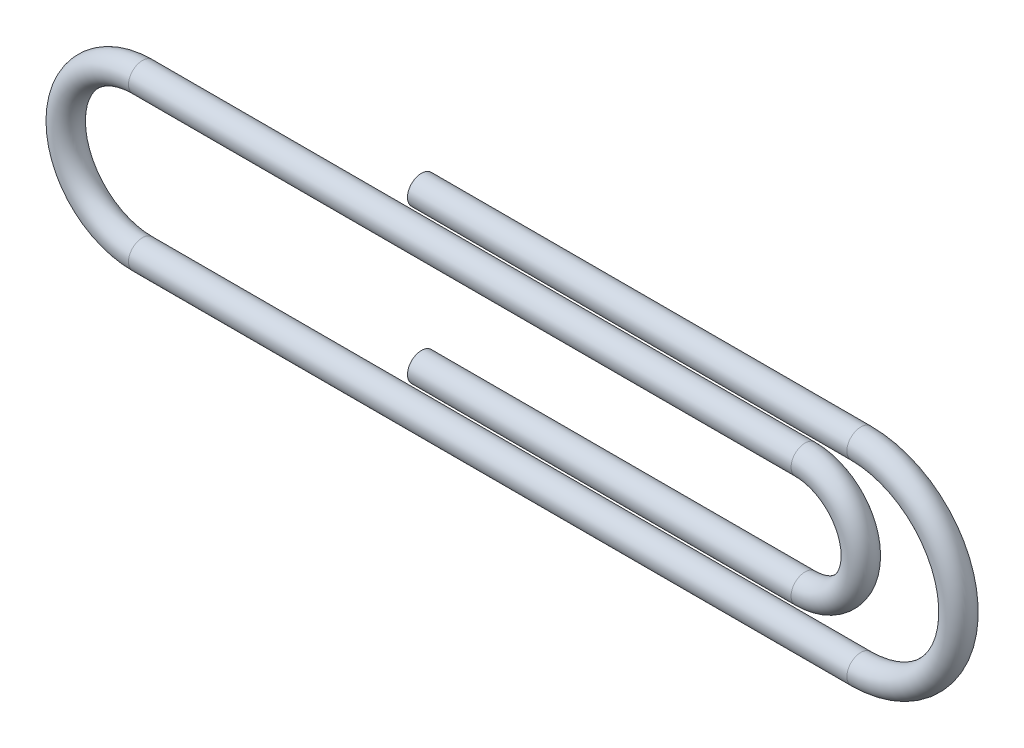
from build123d import *

# Parameters (mm, degrees)
SKETCH2_R = 0.5


with BuildPart() as part:
    # Sweep1: sweep along a path in Sketch1
    with BuildLine(Plane.XY) as sweep1_path:
        Line((-13.75, 3.5), (2, 3.5))
        ThreePointArc((2, 3.5), (5.5, 0), (2, -3.5))
        Line((2, -3.5), (-23.75, -3.5))
        ThreePointArc((-23.75, -3.5), (-26.5, -0.75), (-23.75, 2))
        Line((-23.75, 2), (0, 2))
        ThreePointArc((0, 2), (2, 0), (0, -2))
        Line((0, -2), (-13.75, -2))
    # Sketch2 → Sweep1 (sweep)
    with BuildSketch(Plane(origin=(-13.75, 3.5, 0), x_dir=(0, 0, -1), z_dir=(1, 0, 0))):
        Circle(SKETCH2_R)
    sweep(path=sweep1_path.line)


solid = part.part
